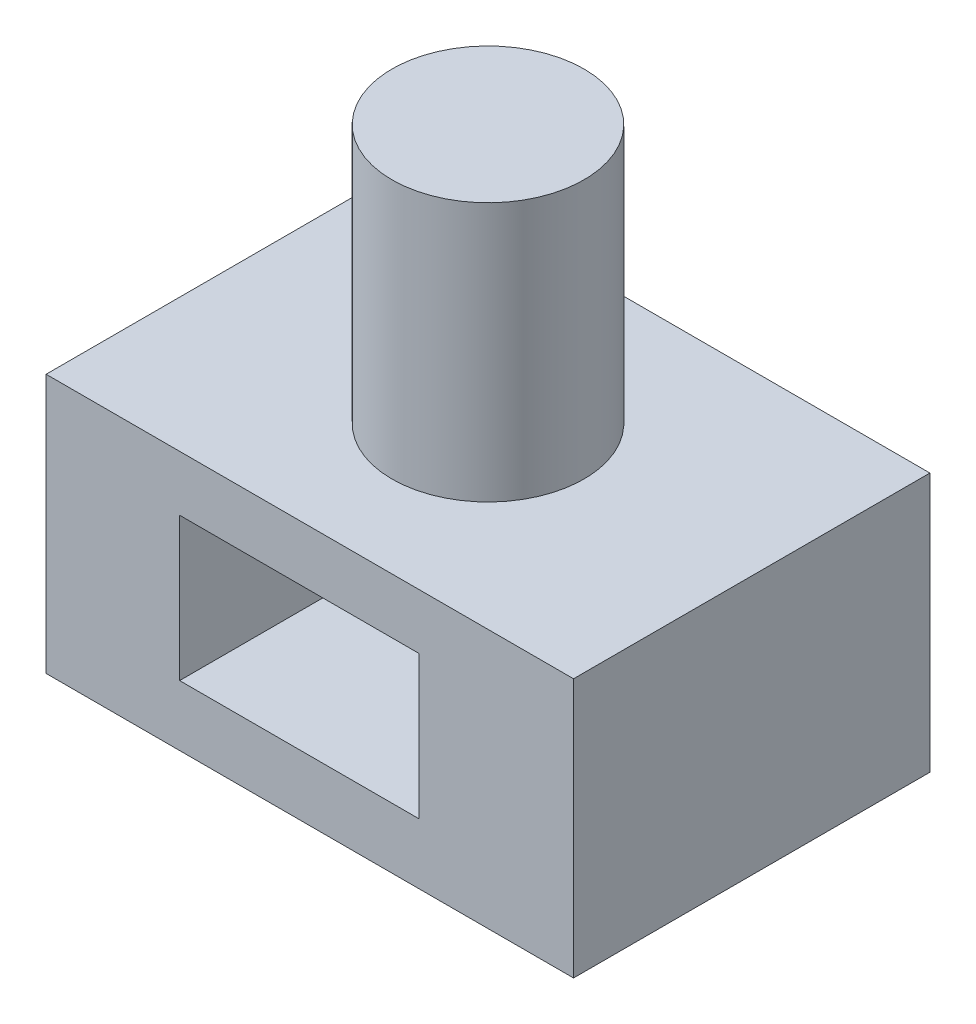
ISO-10303-21;
HEADER;
FILE_DESCRIPTION(('STEP AP214'),'2;1');
FILE_NAME('part.step','',(''),(''),'','','');
FILE_SCHEMA(('AUTOMOTIVE_DESIGN { 1 0 10303 214 1 1 1 1 }'));
ENDSEC;
DATA;
#1=APPLICATION_CONTEXT('core data for automotive mechanical design processes');
#2=APPLICATION_PROTOCOL_DEFINITION('international standard','automotive_design',2000,#1);
#3=PRODUCT_CONTEXT('',#1,'mechanical');
#4=PRODUCT('Part','Part','',(#3));
#5=PRODUCT_RELATED_PRODUCT_CATEGORY('part','',(#4));
#6=PRODUCT_DEFINITION_FORMATION('','',#4);
#7=PRODUCT_DEFINITION_CONTEXT('part definition',#1,'design');
#8=PRODUCT_DEFINITION('design','',#6,#7);
#9=PRODUCT_DEFINITION_SHAPE('','',#8);
#10=(LENGTH_UNIT() NAMED_UNIT(*) SI_UNIT(.MILLI.,.METRE.));
#11=(NAMED_UNIT(*) PLANE_ANGLE_UNIT() SI_UNIT($,.RADIAN.));
#12=(NAMED_UNIT(*) SI_UNIT($,.STERADIAN.) SOLID_ANGLE_UNIT());
#13=UNCERTAINTY_MEASURE_WITH_UNIT(LENGTH_MEASURE(1.E-05),#10,'distance_accuracy_value','');
#14=(GEOMETRIC_REPRESENTATION_CONTEXT(3) GLOBAL_UNCERTAINTY_ASSIGNED_CONTEXT((#13)) GLOBAL_UNIT_ASSIGNED_CONTEXT((#10,
#11,#12)) REPRESENTATION_CONTEXT('',''));
#15=CARTESIAN_POINT('',(0.,0.,0.));
#16=DIRECTION('',(0.,0.,1.));
#17=DIRECTION('',(1.,0.,0.));
#18=AXIS2_PLACEMENT_3D('',#15,#16,#17);
#19=CARTESIAN_POINT('',(-61.0577632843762,60.,41.251364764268));
#20=DIRECTION('',(1.,0.,0.));
#21=DIRECTION('',(0.,0.,-1.));
#22=AXIS2_PLACEMENT_3D('',#19,#20,#21);
#23=PLANE('',#22);
#24=DIRECTION('',(0.,0.,1.));
#25=VECTOR('',#24,1.);
#26=CARTESIAN_POINT('',(-61.0577632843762,0.,41.251364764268));
#27=LINE('',#26,#25);
#28=CARTESIAN_POINT('',(-61.0577632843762,0.,-41.251364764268));
#29=VERTEX_POINT('',#28);
#30=CARTESIAN_POINT('',(-61.0577632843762,0.,41.251364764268));
#31=VERTEX_POINT('',#30);
#32=EDGE_CURVE('E148',#29,#31,#27,.T.);
#33=ORIENTED_EDGE('',*,*,#32,.T.);
#34=DIRECTION('',(0.,-1.,0.));
#35=VECTOR('',#34,1.);
#36=CARTESIAN_POINT('',(-61.0577632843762,60.,41.251364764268));
#37=LINE('',#36,#35);
#38=CARTESIAN_POINT('',(-61.0577632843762,60.,41.251364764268));
#39=VERTEX_POINT('',#38);
#40=EDGE_CURVE('E11',#39,#31,#37,.T.);
#41=ORIENTED_EDGE('',*,*,#40,.F.);
#42=DIRECTION('',(0.,0.,1.));
#43=VECTOR('',#42,1.);
#44=CARTESIAN_POINT('',(-61.0577632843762,60.,41.251364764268));
#45=LINE('',#44,#43);
#46=CARTESIAN_POINT('',(-61.0577632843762,60.,-41.251364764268));
#47=VERTEX_POINT('',#46);
#48=EDGE_CURVE('E151',#47,#39,#45,.T.);
#49=ORIENTED_EDGE('',*,*,#48,.F.);
#50=DIRECTION('',(0.,-1.,0.));
#51=VECTOR('',#50,1.);
#52=CARTESIAN_POINT('',(-61.0577632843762,60.,-41.251364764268));
#53=LINE('',#52,#51);
#54=EDGE_CURVE('E157',#47,#29,#53,.T.);
#55=ORIENTED_EDGE('',*,*,#54,.T.);
#56=EDGE_LOOP('',(#33,#41,#49,#55));
#57=FACE_BOUND('',#56,.T.);
#58=ADVANCED_FACE('F33',(#57),#23,.F.);
#59=CARTESIAN_POINT('',(61.0577632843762,60.,41.251364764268));
#60=DIRECTION('',(0.,0.,-1.));
#61=DIRECTION('',(-1.,0.,0.));
#62=AXIS2_PLACEMENT_3D('',#59,#60,#61);
#63=PLANE('',#62);
#64=DIRECTION('',(1.,0.,0.));
#65=VECTOR('',#64,1.);
#66=CARTESIAN_POINT('',(25.285915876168,14.0331068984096,41.251364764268));
#67=LINE('',#66,#65);
#68=CARTESIAN_POINT('',(-30.1403403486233,14.0331068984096,41.251364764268));
#69=VERTEX_POINT('',#68);
#70=CARTESIAN_POINT('',(25.285915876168,14.0331068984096,41.251364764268));
#71=VERTEX_POINT('',#70);
#72=EDGE_CURVE('E135',#69,#71,#67,.T.);
#73=ORIENTED_EDGE('',*,*,#72,.F.);
#74=DIRECTION('',(0.,-1.,0.));
#75=VECTOR('',#74,1.);
#76=CARTESIAN_POINT('',(-30.1403403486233,14.0331068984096,41.251364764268));
#77=LINE('',#76,#75);
#78=CARTESIAN_POINT('',(-30.1403403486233,47.1855706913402,41.251364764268));
#79=VERTEX_POINT('',#78);
#80=EDGE_CURVE('E47',#79,#69,#77,.T.);
#81=ORIENTED_EDGE('',*,*,#80,.F.);
#82=DIRECTION('',(-1.,0.,0.));
#83=VECTOR('',#82,1.);
#84=CARTESIAN_POINT('',(25.285915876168,47.1855706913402,41.251364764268));
#85=LINE('',#84,#83);
#86=CARTESIAN_POINT('',(25.285915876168,47.1855706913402,41.251364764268));
#87=VERTEX_POINT('',#86);
#88=EDGE_CURVE('E126',#87,#79,#85,.T.);
#89=ORIENTED_EDGE('',*,*,#88,.F.);
#90=DIRECTION('',(0.,1.,0.));
#91=VECTOR('',#90,1.);
#92=CARTESIAN_POINT('',(25.285915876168,14.0331068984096,41.251364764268));
#93=LINE('',#92,#91);
#94=EDGE_CURVE('E129',#71,#87,#93,.T.);
#95=ORIENTED_EDGE('',*,*,#94,.F.);
#96=EDGE_LOOP('',(#73,#81,#89,#95));
#97=FACE_BOUND('',#96,.T.);
#98=DIRECTION('',(1.,0.,0.));
#99=VECTOR('',#98,1.);
#100=CARTESIAN_POINT('',(61.0577632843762,0.,41.251364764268));
#101=LINE('',#100,#99);
#102=CARTESIAN_POINT('',(61.0577632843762,0.,41.251364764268));
#103=VERTEX_POINT('',#102);
#104=EDGE_CURVE('E160',#31,#103,#101,.T.);
#105=ORIENTED_EDGE('',*,*,#104,.T.);
#106=DIRECTION('',(0.,-1.,0.));
#107=VECTOR('',#106,1.);
#108=CARTESIAN_POINT('',(61.0577632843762,60.,41.251364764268));
#109=LINE('',#108,#107);
#110=CARTESIAN_POINT('',(61.0577632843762,60.,41.251364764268));
#111=VERTEX_POINT('',#110);
#112=EDGE_CURVE('E40',#111,#103,#109,.T.);
#113=ORIENTED_EDGE('',*,*,#112,.F.);
#114=DIRECTION('',(1.,0.,0.));
#115=VECTOR('',#114,1.);
#116=CARTESIAN_POINT('',(61.0577632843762,60.,41.251364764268));
#117=LINE('',#116,#115);
#118=EDGE_CURVE('E84',#39,#111,#117,.T.);
#119=ORIENTED_EDGE('',*,*,#118,.F.);
#120=ORIENTED_EDGE('',*,*,#40,.T.);
#121=EDGE_LOOP('',(#105,#113,#119,#120));
#122=FACE_BOUND('',#121,.T.);
#123=ADVANCED_FACE('F189',(#97,#122),#63,.F.);
#124=CARTESIAN_POINT('',(61.0577632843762,60.,41.251364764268));
#125=DIRECTION('',(-1.,0.,0.));
#126=DIRECTION('',(0.,0.,1.));
#127=AXIS2_PLACEMENT_3D('',#124,#125,#126);
#128=PLANE('',#127);
#129=DIRECTION('',(0.,0.,-1.));
#130=VECTOR('',#129,1.);
#131=CARTESIAN_POINT('',(61.0577632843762,0.,41.251364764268));
#132=LINE('',#131,#130);
#133=CARTESIAN_POINT('',(61.0577632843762,0.,-41.251364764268));
#134=VERTEX_POINT('',#133);
#135=EDGE_CURVE('E162',#103,#134,#132,.T.);
#136=ORIENTED_EDGE('',*,*,#135,.T.);
#137=DIRECTION('',(0.,-1.,0.));
#138=VECTOR('',#137,1.);
#139=CARTESIAN_POINT('',(61.0577632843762,60.,-41.251364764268));
#140=LINE('',#139,#138);
#141=CARTESIAN_POINT('',(61.0577632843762,60.,-41.251364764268));
#142=VERTEX_POINT('',#141);
#143=EDGE_CURVE('E166',#142,#134,#140,.T.);
#144=ORIENTED_EDGE('',*,*,#143,.F.);
#145=DIRECTION('',(0.,0.,-1.));
#146=VECTOR('',#145,1.);
#147=CARTESIAN_POINT('',(61.0577632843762,60.,41.251364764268));
#148=LINE('',#147,#146);
#149=EDGE_CURVE('E154',#111,#142,#148,.T.);
#150=ORIENTED_EDGE('',*,*,#149,.F.);
#151=ORIENTED_EDGE('',*,*,#112,.T.);
#152=EDGE_LOOP('',(#136,#144,#150,#151));
#153=FACE_BOUND('',#152,.T.);
#154=ADVANCED_FACE('F171',(#153),#128,.F.);
#155=CARTESIAN_POINT('',(61.0577632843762,60.,-41.251364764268));
#156=DIRECTION('',(0.,0.,1.));
#157=DIRECTION('',(1.,0.,0.));
#158=AXIS2_PLACEMENT_3D('',#155,#156,#157);
#159=PLANE('',#158);
#160=DIRECTION('',(-1.,0.,0.));
#161=VECTOR('',#160,1.);
#162=CARTESIAN_POINT('',(61.0577632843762,0.,-41.251364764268));
#163=LINE('',#162,#161);
#164=EDGE_CURVE('E77',#134,#29,#163,.T.);
#165=ORIENTED_EDGE('',*,*,#164,.T.);
#166=ORIENTED_EDGE('',*,*,#54,.F.);
#167=DIRECTION('',(-1.,0.,0.));
#168=VECTOR('',#167,1.);
#169=CARTESIAN_POINT('',(61.0577632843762,60.,-41.251364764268));
#170=LINE('',#169,#168);
#171=EDGE_CURVE('E56',#142,#47,#170,.T.);
#172=ORIENTED_EDGE('',*,*,#171,.F.);
#173=ORIENTED_EDGE('',*,*,#143,.T.);
#174=EDGE_LOOP('',(#165,#166,#172,#173));
#175=FACE_BOUND('',#174,.T.);
#176=ADVANCED_FACE('F179',(#175),#159,.F.);
#177=CARTESIAN_POINT('',(0.,60.,0.));
#178=DIRECTION('',(0.,1.,0.));
#179=DIRECTION('',(0.,0.,1.));
#180=AXIS2_PLACEMENT_3D('',#177,#178,#179);
#181=PLANE('',#180);
#182=CARTESIAN_POINT('',(0.,60.,0.));
#183=DIRECTION('',(0.,1.,0.));
#184=DIRECTION('',(0.,0.,1.));
#185=AXIS2_PLACEMENT_3D('',#182,#183,#184);
#186=CIRCLE('',#185,22.2340281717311);
#187=CARTESIAN_POINT('',(0.,60.,-22.2340281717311));
#188=VERTEX_POINT('',#187);
#189=EDGE_CURVE('E141',#188,#188,#186,.T.);
#190=ORIENTED_EDGE('',*,*,#189,.F.);
#191=EDGE_LOOP('',(#190));
#192=FACE_BOUND('',#191,.T.);
#193=ORIENTED_EDGE('',*,*,#48,.T.);
#194=ORIENTED_EDGE('',*,*,#118,.T.);
#195=ORIENTED_EDGE('',*,*,#149,.T.);
#196=ORIENTED_EDGE('',*,*,#171,.T.);
#197=EDGE_LOOP('',(#193,#194,#195,#196));
#198=FACE_BOUND('',#197,.T.);
#199=ADVANCED_FACE('F181',(#192,#198),#181,.T.);
#200=CARTESIAN_POINT('',(0.,0.,0.));
#201=DIRECTION('',(0.,1.,0.));
#202=DIRECTION('',(0.,0.,1.));
#203=AXIS2_PLACEMENT_3D('',#200,#201,#202);
#204=PLANE('',#203);
#205=ORIENTED_EDGE('',*,*,#32,.F.);
#206=ORIENTED_EDGE('',*,*,#164,.F.);
#207=ORIENTED_EDGE('',*,*,#135,.F.);
#208=ORIENTED_EDGE('',*,*,#104,.F.);
#209=EDGE_LOOP('',(#205,#206,#207,#208));
#210=FACE_BOUND('',#209,.T.);
#211=ADVANCED_FACE('F175',(#210),#204,.F.);
#212=CARTESIAN_POINT('',(0.,120.,0.));
#213=DIRECTION('',(0.,-1.,0.));
#214=DIRECTION('',(0.,0.,-1.));
#215=AXIS2_PLACEMENT_3D('',#212,#213,#214);
#216=CYLINDRICAL_SURFACE('',#215,22.2340281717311);
#217=CARTESIAN_POINT('',(0.,120.,0.));
#218=DIRECTION('',(0.,1.,0.));
#219=DIRECTION('',(0.,0.,1.));
#220=AXIS2_PLACEMENT_3D('',#217,#218,#219);
#221=CIRCLE('',#220,22.2340281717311);
#222=CARTESIAN_POINT('',(0.,120.,-22.2340281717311));
#223=VERTEX_POINT('',#222);
#224=EDGE_CURVE('E145',#223,#223,#221,.T.);
#225=CARTESIAN_POINT('',(0.,120.,-22.2340281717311));
#226=CARTESIAN_POINT('',(0.,119.375,-22.2340281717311));
#227=CARTESIAN_POINT('',(0.,118.75,-22.2340281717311));
#228=CARTESIAN_POINT('',(0.,117.5,-22.2340281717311));
#229=CARTESIAN_POINT('',(0.,116.875,-22.2340281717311));
#230=CARTESIAN_POINT('',(0.,115.625,-22.2340281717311));
#231=CARTESIAN_POINT('',(0.,115.,-22.2340281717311));
#232=CARTESIAN_POINT('',(0.,113.75,-22.2340281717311));
#233=CARTESIAN_POINT('',(0.,113.125,-22.2340281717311));
#234=CARTESIAN_POINT('',(0.,111.875,-22.2340281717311));
#235=CARTESIAN_POINT('',(0.,111.25,-22.2340281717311));
#236=CARTESIAN_POINT('',(0.,110.,-22.2340281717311));
#237=CARTESIAN_POINT('',(0.,109.375,-22.2340281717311));
#238=CARTESIAN_POINT('',(0.,108.125,-22.2340281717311));
#239=CARTESIAN_POINT('',(0.,107.5,-22.2340281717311));
#240=CARTESIAN_POINT('',(0.,106.25,-22.2340281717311));
#241=CARTESIAN_POINT('',(0.,105.625,-22.2340281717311));
#242=CARTESIAN_POINT('',(0.,104.375,-22.2340281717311));
#243=CARTESIAN_POINT('',(0.,103.75,-22.2340281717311));
#244=CARTESIAN_POINT('',(0.,102.5,-22.2340281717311));
#245=CARTESIAN_POINT('',(0.,101.875,-22.2340281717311));
#246=CARTESIAN_POINT('',(0.,100.625,-22.2340281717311));
#247=CARTESIAN_POINT('',(0.,100.,-22.2340281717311));
#248=CARTESIAN_POINT('',(0.,98.75,-22.2340281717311));
#249=CARTESIAN_POINT('',(0.,98.125,-22.2340281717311));
#250=CARTESIAN_POINT('',(0.,96.875,-22.2340281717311));
#251=CARTESIAN_POINT('',(0.,96.25,-22.2340281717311));
#252=CARTESIAN_POINT('',(0.,95.,-22.2340281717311));
#253=CARTESIAN_POINT('',(0.,94.375,-22.2340281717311));
#254=CARTESIAN_POINT('',(0.,93.125,-22.2340281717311));
#255=CARTESIAN_POINT('',(0.,92.5,-22.2340281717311));
#256=CARTESIAN_POINT('',(0.,91.25,-22.2340281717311));
#257=CARTESIAN_POINT('',(0.,90.625,-22.2340281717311));
#258=CARTESIAN_POINT('',(0.,89.375,-22.2340281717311));
#259=CARTESIAN_POINT('',(0.,88.75,-22.2340281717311));
#260=CARTESIAN_POINT('',(0.,87.5,-22.2340281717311));
#261=CARTESIAN_POINT('',(0.,86.875,-22.2340281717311));
#262=CARTESIAN_POINT('',(0.,85.625,-22.2340281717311));
#263=CARTESIAN_POINT('',(0.,85.,-22.2340281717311));
#264=CARTESIAN_POINT('',(0.,83.75,-22.2340281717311));
#265=CARTESIAN_POINT('',(0.,83.125,-22.2340281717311));
#266=CARTESIAN_POINT('',(0.,81.875,-22.2340281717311));
#267=CARTESIAN_POINT('',(0.,81.25,-22.2340281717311));
#268=CARTESIAN_POINT('',(0.,80.,-22.2340281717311));
#269=CARTESIAN_POINT('',(0.,79.375,-22.2340281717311));
#270=CARTESIAN_POINT('',(0.,78.125,-22.2340281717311));
#271=CARTESIAN_POINT('',(0.,77.5,-22.2340281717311));
#272=CARTESIAN_POINT('',(0.,76.25,-22.2340281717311));
#273=CARTESIAN_POINT('',(0.,75.625,-22.2340281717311));
#274=CARTESIAN_POINT('',(0.,74.375,-22.2340281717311));
#275=CARTESIAN_POINT('',(0.,73.75,-22.2340281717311));
#276=CARTESIAN_POINT('',(0.,72.5,-22.2340281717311));
#277=CARTESIAN_POINT('',(0.,71.875,-22.2340281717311));
#278=CARTESIAN_POINT('',(0.,70.625,-22.2340281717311));
#279=CARTESIAN_POINT('',(0.,70.,-22.2340281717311));
#280=CARTESIAN_POINT('',(0.,68.75,-22.2340281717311));
#281=CARTESIAN_POINT('',(0.,68.125,-22.2340281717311));
#282=CARTESIAN_POINT('',(0.,66.875,-22.2340281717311));
#283=CARTESIAN_POINT('',(0.,66.25,-22.2340281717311));
#284=CARTESIAN_POINT('',(0.,65.,-22.2340281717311));
#285=CARTESIAN_POINT('',(0.,64.375,-22.2340281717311));
#286=CARTESIAN_POINT('',(0.,63.125,-22.2340281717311));
#287=CARTESIAN_POINT('',(0.,62.5,-22.2340281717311));
#288=CARTESIAN_POINT('',(0.,61.25,-22.2340281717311));
#289=CARTESIAN_POINT('',(0.,60.625,-22.2340281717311));
#290=CARTESIAN_POINT('',(0.,60.,-22.2340281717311));
#291=B_SPLINE_CURVE_WITH_KNOTS('',3,(#225,#226,#227,#228,#229,#230,#231,#232,#233,#234,#235,
#236,#237,#238,#239,#240,#241,#242,#243,#244,#245,#246,#247,#248,#249,#250,#251,#252,#253,#254,
#255,#256,#257,#258,#259,#260,#261,#262,#263,#264,#265,#266,#267,#268,#269,#270,#271,#272,#273,
#274,#275,#276,#277,#278,#279,#280,#281,#282,#283,#284,#285,#286,#287,#288,#289,#290),
.UNSPECIFIED.,.F.,.F.,(4,2,2,2,2,2,2,2,2,2,2,2,2,2,2,2,2,2,2,2,2,2,2,2,2,2,2,2,2,2,2,2,4),(0.,
1.87499999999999,3.74999999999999,5.62499999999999,7.49999999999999,9.37499999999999,11.25,
13.125,15.,16.875,18.75,20.625,22.5,24.375,26.25,28.125,30.,31.875,33.75,35.625,37.5,39.375,
41.25,43.125,45.,46.875,48.75,50.625,52.5,54.375,56.25,58.125,60.),.UNSPECIFIED.);
#292=EDGE_CURVE('BSEAM220',#223,#188,#291,.T.);
#293=ORIENTED_EDGE('',*,*,#224,.F.);
#294=ORIENTED_EDGE('',*,*,#189,.T.);
#295=ORIENTED_EDGE('',*,*,#292,.T.);
#296=ORIENTED_EDGE('',*,*,#292,.F.);
#297=EDGE_LOOP('',(#293,#295,#294,#296));
#298=FACE_BOUND('',#297,.T.);
#299=ADVANCED_FACE('F220',(#298),#216,.T.);
#300=CARTESIAN_POINT('',(0.,120.,0.));
#301=DIRECTION('',(0.,1.,0.));
#302=DIRECTION('',(0.,0.,1.));
#303=AXIS2_PLACEMENT_3D('',#300,#301,#302);
#304=PLANE('',#303);
#305=ORIENTED_EDGE('',*,*,#224,.T.);
#306=EDGE_LOOP('',(#305));
#307=FACE_BOUND('',#306,.T.);
#308=ADVANCED_FACE('F212',(#307),#304,.T.);
#309=CARTESIAN_POINT('',(-30.1403403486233,14.0331068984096,-18.748635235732));
#310=DIRECTION('',(-1.,0.,0.));
#311=DIRECTION('',(0.,0.,1.));
#312=AXIS2_PLACEMENT_3D('',#309,#310,#311);
#313=PLANE('',#312);
#314=ORIENTED_EDGE('',*,*,#80,.T.);
#315=DIRECTION('',(0.,0.,1.));
#316=VECTOR('',#315,1.);
#317=CARTESIAN_POINT('',(-30.1403403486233,14.0331068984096,-18.748635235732));
#318=LINE('',#317,#316);
#319=CARTESIAN_POINT('',(-30.1403403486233,14.0331068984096,-18.748635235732));
#320=VERTEX_POINT('',#319);
#321=EDGE_CURVE('E104',#320,#69,#318,.T.);
#322=ORIENTED_EDGE('',*,*,#321,.F.);
#323=DIRECTION('',(0.,-1.,0.));
#324=VECTOR('',#323,1.);
#325=CARTESIAN_POINT('',(-30.1403403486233,14.0331068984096,-18.748635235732));
#326=LINE('',#325,#324);
#327=CARTESIAN_POINT('',(-30.1403403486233,47.1855706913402,-18.748635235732));
#328=VERTEX_POINT('',#327);
#329=EDGE_CURVE('E108',#328,#320,#326,.T.);
#330=ORIENTED_EDGE('',*,*,#329,.F.);
#331=DIRECTION('',(0.,0.,1.));
#332=VECTOR('',#331,1.);
#333=CARTESIAN_POINT('',(-30.1403403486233,47.1855706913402,-18.748635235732));
#334=LINE('',#333,#332);
#335=EDGE_CURVE('E139',#328,#79,#334,.T.);
#336=ORIENTED_EDGE('',*,*,#335,.T.);
#337=EDGE_LOOP('',(#314,#322,#330,#336));
#338=FACE_BOUND('',#337,.T.);
#339=ADVANCED_FACE('F106',(#338),#313,.F.);
#340=CARTESIAN_POINT('',(25.285915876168,47.1855706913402,-18.748635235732));
#341=DIRECTION('',(0.,1.,0.));
#342=DIRECTION('',(0.,0.,1.));
#343=AXIS2_PLACEMENT_3D('',#340,#341,#342);
#344=PLANE('',#343);
#345=ORIENTED_EDGE('',*,*,#88,.T.);
#346=ORIENTED_EDGE('',*,*,#335,.F.);
#347=DIRECTION('',(-1.,0.,0.));
#348=VECTOR('',#347,1.);
#349=CARTESIAN_POINT('',(25.285915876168,47.1855706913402,-18.748635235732));
#350=LINE('',#349,#348);
#351=CARTESIAN_POINT('',(25.285915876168,47.1855706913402,-18.748635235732));
#352=VERTEX_POINT('',#351);
#353=EDGE_CURVE('E114',#352,#328,#350,.T.);
#354=ORIENTED_EDGE('',*,*,#353,.F.);
#355=DIRECTION('',(0.,0.,1.));
#356=VECTOR('',#355,1.);
#357=CARTESIAN_POINT('',(25.285915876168,47.1855706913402,-18.748635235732));
#358=LINE('',#357,#356);
#359=EDGE_CURVE('E142',#352,#87,#358,.T.);
#360=ORIENTED_EDGE('',*,*,#359,.T.);
#361=EDGE_LOOP('',(#345,#346,#354,#360));
#362=FACE_BOUND('',#361,.T.);
#363=ADVANCED_FACE('F204',(#362),#344,.F.);
#364=CARTESIAN_POINT('',(25.285915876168,14.0331068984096,-18.748635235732));
#365=DIRECTION('',(1.,0.,0.));
#366=DIRECTION('',(0.,0.,-1.));
#367=AXIS2_PLACEMENT_3D('',#364,#365,#366);
#368=PLANE('',#367);
#369=ORIENTED_EDGE('',*,*,#94,.T.);
#370=ORIENTED_EDGE('',*,*,#359,.F.);
#371=DIRECTION('',(0.,1.,0.));
#372=VECTOR('',#371,1.);
#373=CARTESIAN_POINT('',(25.285915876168,14.0331068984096,-18.748635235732));
#374=LINE('',#373,#372);
#375=CARTESIAN_POINT('',(25.285915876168,14.0331068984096,-18.748635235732));
#376=VERTEX_POINT('',#375);
#377=EDGE_CURVE('E122',#376,#352,#374,.T.);
#378=ORIENTED_EDGE('',*,*,#377,.F.);
#379=DIRECTION('',(0.,0.,1.));
#380=VECTOR('',#379,1.);
#381=CARTESIAN_POINT('',(25.285915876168,14.0331068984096,-18.748635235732));
#382=LINE('',#381,#380);
#383=EDGE_CURVE('E113',#376,#71,#382,.T.);
#384=ORIENTED_EDGE('',*,*,#383,.T.);
#385=EDGE_LOOP('',(#369,#370,#378,#384));
#386=FACE_BOUND('',#385,.T.);
#387=ADVANCED_FACE('F202',(#386),#368,.F.);
#388=CARTESIAN_POINT('',(25.285915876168,14.0331068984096,-18.748635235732));
#389=DIRECTION('',(0.,-1.,0.));
#390=DIRECTION('',(0.,0.,-1.));
#391=AXIS2_PLACEMENT_3D('',#388,#389,#390);
#392=PLANE('',#391);
#393=ORIENTED_EDGE('',*,*,#72,.T.);
#394=ORIENTED_EDGE('',*,*,#383,.F.);
#395=DIRECTION('',(1.,0.,0.));
#396=VECTOR('',#395,1.);
#397=CARTESIAN_POINT('',(25.285915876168,14.0331068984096,-18.748635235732));
#398=LINE('',#397,#396);
#399=EDGE_CURVE('E117',#320,#376,#398,.T.);
#400=ORIENTED_EDGE('',*,*,#399,.F.);
#401=ORIENTED_EDGE('',*,*,#321,.T.);
#402=EDGE_LOOP('',(#393,#394,#400,#401));
#403=FACE_BOUND('',#402,.T.);
#404=ADVANCED_FACE('F118',(#403),#392,.F.);
#405=CARTESIAN_POINT('',(0.,0.,-18.748635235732));
#406=DIRECTION('',(0.,0.,1.));
#407=DIRECTION('',(1.,0.,0.));
#408=AXIS2_PLACEMENT_3D('',#405,#406,#407);
#409=PLANE('',#408);
#410=ORIENTED_EDGE('',*,*,#329,.T.);
#411=ORIENTED_EDGE('',*,*,#399,.T.);
#412=ORIENTED_EDGE('',*,*,#377,.T.);
#413=ORIENTED_EDGE('',*,*,#353,.T.);
#414=EDGE_LOOP('',(#410,#411,#412,#413));
#415=FACE_BOUND('',#414,.T.);
#416=ADVANCED_FACE('F124',(#415),#409,.T.);
#417=CLOSED_SHELL('',(#58,#123,#154,#176,#199,#211,#299,#308,#339,#363,#387,#404,#416));
#418=MANIFOLD_SOLID_BREP('B2',#417);
#419=ADVANCED_BREP_SHAPE_REPRESENTATION('',(#18,#418),#14);
#420=SHAPE_DEFINITION_REPRESENTATION(#9,#419);
ENDSEC;
END-ISO-10303-21;
